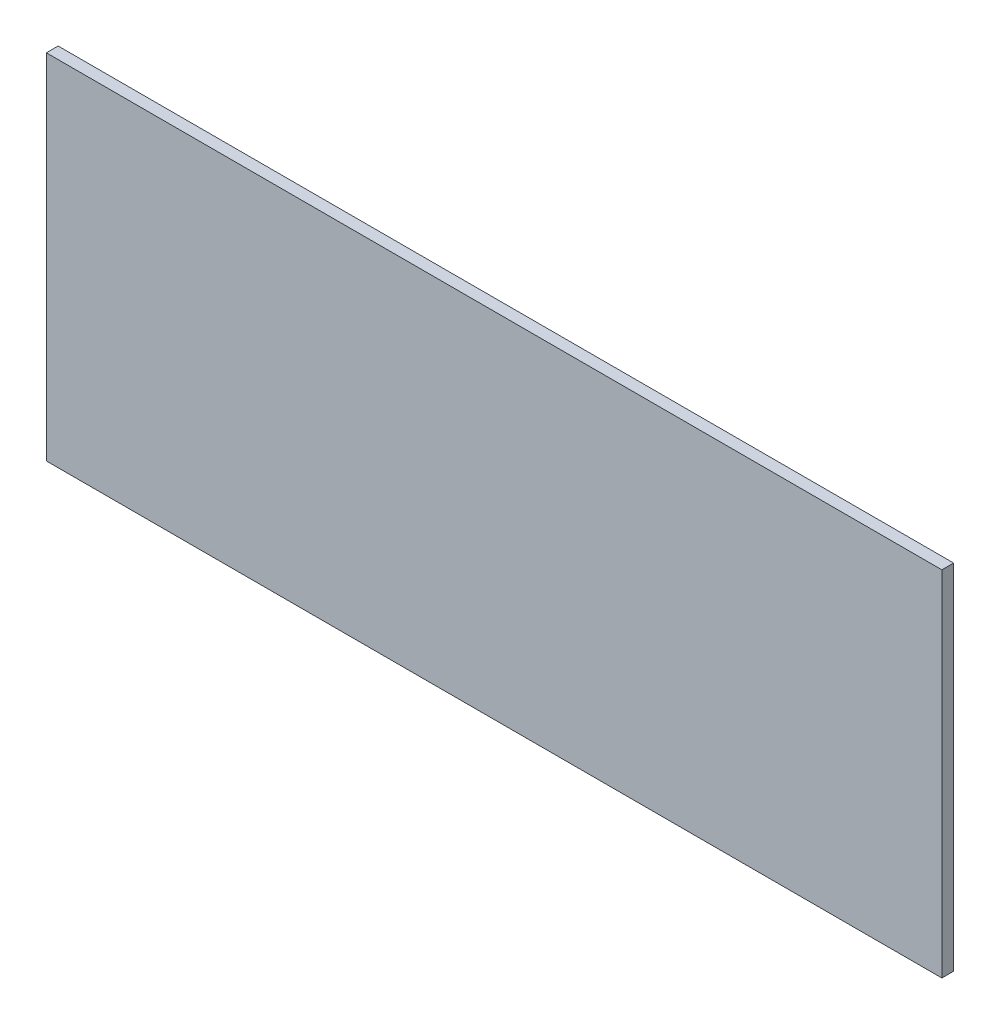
ISO-10303-21;
HEADER;
FILE_DESCRIPTION(('STEP AP214'),'2;1');
FILE_NAME('part.step','',(''),(''),'','','');
FILE_SCHEMA(('AUTOMOTIVE_DESIGN { 1 0 10303 214 1 1 1 1 }'));
ENDSEC;
DATA;
#1=APPLICATION_CONTEXT('core data for automotive mechanical design processes');
#2=APPLICATION_PROTOCOL_DEFINITION('international standard','automotive_design',2000,#1);
#3=PRODUCT_CONTEXT('',#1,'mechanical');
#4=PRODUCT('Part','Part','',(#3));
#5=PRODUCT_RELATED_PRODUCT_CATEGORY('part','',(#4));
#6=PRODUCT_DEFINITION_FORMATION('','',#4);
#7=PRODUCT_DEFINITION_CONTEXT('part definition',#1,'design');
#8=PRODUCT_DEFINITION('design','',#6,#7);
#9=PRODUCT_DEFINITION_SHAPE('','',#8);
#10=(LENGTH_UNIT() NAMED_UNIT(*) SI_UNIT(.MILLI.,.METRE.));
#11=(NAMED_UNIT(*) PLANE_ANGLE_UNIT() SI_UNIT($,.RADIAN.));
#12=(NAMED_UNIT(*) SI_UNIT($,.STERADIAN.) SOLID_ANGLE_UNIT());
#13=UNCERTAINTY_MEASURE_WITH_UNIT(LENGTH_MEASURE(1.E-05),#10,'distance_accuracy_value','');
#14=(GEOMETRIC_REPRESENTATION_CONTEXT(3) GLOBAL_UNCERTAINTY_ASSIGNED_CONTEXT((#13)) GLOBAL_UNIT_ASSIGNED_CONTEXT((#10,
#11,#12)) REPRESENTATION_CONTEXT('',''));
#15=CARTESIAN_POINT('',(0.,0.,0.));
#16=DIRECTION('',(0.,0.,1.));
#17=DIRECTION('',(1.,0.,0.));
#18=AXIS2_PLACEMENT_3D('',#15,#16,#17);
#19=CARTESIAN_POINT('',(-15.,-7.5,0.6));
#20=DIRECTION('',(1.,0.,0.));
#21=DIRECTION('',(0.,0.,-1.));
#22=AXIS2_PLACEMENT_3D('',#19,#20,#21);
#23=PLANE('',#22);
#24=DIRECTION('',(0.,-1.,0.));
#25=VECTOR('',#24,1.);
#26=CARTESIAN_POINT('',(-15.,-7.5,0.1));
#27=LINE('',#26,#25);
#28=CARTESIAN_POINT('',(-15.,7.5,0.1));
#29=VERTEX_POINT('',#28);
#30=CARTESIAN_POINT('',(-15.,-7.5,0.1));
#31=VERTEX_POINT('',#30);
#32=EDGE_CURVE('E95',#29,#31,#27,.T.);
#33=ORIENTED_EDGE('',*,*,#32,.T.);
#34=DIRECTION('',(0.,0.,-1.));
#35=VECTOR('',#34,1.);
#36=CARTESIAN_POINT('',(-15.,-7.5,0.6));
#37=LINE('',#36,#35);
#38=CARTESIAN_POINT('',(-15.,-7.5,0.6));
#39=VERTEX_POINT('',#38);
#40=EDGE_CURVE('E11',#39,#31,#37,.T.);
#41=ORIENTED_EDGE('',*,*,#40,.F.);
#42=DIRECTION('',(0.,-1.,0.));
#43=VECTOR('',#42,1.);
#44=CARTESIAN_POINT('',(-15.,-7.5,0.6));
#45=LINE('',#44,#43);
#46=CARTESIAN_POINT('',(-15.,7.5,0.6));
#47=VERTEX_POINT('',#46);
#48=EDGE_CURVE('E83',#47,#39,#45,.T.);
#49=ORIENTED_EDGE('',*,*,#48,.F.);
#50=DIRECTION('',(0.,0.,-1.));
#51=VECTOR('',#50,1.);
#52=CARTESIAN_POINT('',(-15.,7.5,0.6));
#53=LINE('',#52,#51);
#54=EDGE_CURVE('E91',#47,#29,#53,.T.);
#55=ORIENTED_EDGE('',*,*,#54,.T.);
#56=EDGE_LOOP('',(#33,#41,#49,#55));
#57=FACE_BOUND('',#56,.T.);
#58=ADVANCED_FACE('F32',(#57),#23,.F.);
#59=CARTESIAN_POINT('',(-15.,-7.5,0.6));
#60=DIRECTION('',(0.,1.,0.));
#61=DIRECTION('',(0.,0.,1.));
#62=AXIS2_PLACEMENT_3D('',#59,#60,#61);
#63=PLANE('',#62);
#64=DIRECTION('',(1.,0.,0.));
#65=VECTOR('',#64,1.);
#66=CARTESIAN_POINT('',(-15.,-7.5,0.1));
#67=LINE('',#66,#65);
#68=CARTESIAN_POINT('',(23.,-7.5,0.1));
#69=VERTEX_POINT('',#68);
#70=EDGE_CURVE('E87',#31,#69,#67,.T.);
#71=ORIENTED_EDGE('',*,*,#70,.T.);
#72=DIRECTION('',(0.,0.,-1.));
#73=VECTOR('',#72,1.);
#74=CARTESIAN_POINT('',(23.,-7.5,0.6));
#75=LINE('',#74,#73);
#76=CARTESIAN_POINT('',(23.,-7.5,0.6));
#77=VERTEX_POINT('',#76);
#78=EDGE_CURVE('E40',#77,#69,#75,.T.);
#79=ORIENTED_EDGE('',*,*,#78,.F.);
#80=DIRECTION('',(1.,0.,0.));
#81=VECTOR('',#80,1.);
#82=CARTESIAN_POINT('',(-15.,-7.5,0.6));
#83=LINE('',#82,#81);
#84=EDGE_CURVE('E78',#39,#77,#83,.T.);
#85=ORIENTED_EDGE('',*,*,#84,.F.);
#86=ORIENTED_EDGE('',*,*,#40,.T.);
#87=EDGE_LOOP('',(#71,#79,#85,#86));
#88=FACE_BOUND('',#87,.T.);
#89=ADVANCED_FACE('F86',(#88),#63,.F.);
#90=CARTESIAN_POINT('',(23.,-7.5,0.6));
#91=DIRECTION('',(-1.,0.,0.));
#92=DIRECTION('',(0.,0.,1.));
#93=AXIS2_PLACEMENT_3D('',#90,#91,#92);
#94=PLANE('',#93);
#95=DIRECTION('',(0.,1.,0.));
#96=VECTOR('',#95,1.);
#97=CARTESIAN_POINT('',(23.,-7.5,0.1));
#98=LINE('',#97,#96);
#99=CARTESIAN_POINT('',(23.,7.5,0.1));
#100=VERTEX_POINT('',#99);
#101=EDGE_CURVE('E65',#69,#100,#98,.T.);
#102=ORIENTED_EDGE('',*,*,#101,.T.);
#103=DIRECTION('',(0.,0.,-1.));
#104=VECTOR('',#103,1.);
#105=CARTESIAN_POINT('',(23.,7.5,0.6));
#106=LINE('',#105,#104);
#107=CARTESIAN_POINT('',(23.,7.5,0.6));
#108=VERTEX_POINT('',#107);
#109=EDGE_CURVE('E88',#108,#100,#106,.T.);
#110=ORIENTED_EDGE('',*,*,#109,.F.);
#111=DIRECTION('',(0.,1.,0.));
#112=VECTOR('',#111,1.);
#113=CARTESIAN_POINT('',(23.,-7.5,0.6));
#114=LINE('',#113,#112);
#115=EDGE_CURVE('E81',#77,#108,#114,.T.);
#116=ORIENTED_EDGE('',*,*,#115,.F.);
#117=ORIENTED_EDGE('',*,*,#78,.T.);
#118=EDGE_LOOP('',(#102,#110,#116,#117));
#119=FACE_BOUND('',#118,.T.);
#120=ADVANCED_FACE('F89',(#119),#94,.F.);
#121=CARTESIAN_POINT('',(-15.,7.5,0.6));
#122=DIRECTION('',(0.,-1.,0.));
#123=DIRECTION('',(0.,0.,-1.));
#124=AXIS2_PLACEMENT_3D('',#121,#122,#123);
#125=PLANE('',#124);
#126=DIRECTION('',(-1.,0.,0.));
#127=VECTOR('',#126,1.);
#128=CARTESIAN_POINT('',(-15.,7.5,0.1));
#129=LINE('',#128,#127);
#130=EDGE_CURVE('E71',#100,#29,#129,.T.);
#131=ORIENTED_EDGE('',*,*,#130,.T.);
#132=ORIENTED_EDGE('',*,*,#54,.F.);
#133=DIRECTION('',(-1.,0.,0.));
#134=VECTOR('',#133,1.);
#135=CARTESIAN_POINT('',(-15.,7.5,0.6));
#136=LINE('',#135,#134);
#137=EDGE_CURVE('E48',#108,#47,#136,.T.);
#138=ORIENTED_EDGE('',*,*,#137,.F.);
#139=ORIENTED_EDGE('',*,*,#109,.T.);
#140=EDGE_LOOP('',(#131,#132,#138,#139));
#141=FACE_BOUND('',#140,.T.);
#142=ADVANCED_FACE('F102',(#141),#125,.F.);
#143=CARTESIAN_POINT('',(0.,0.,0.6));
#144=DIRECTION('',(0.,0.,-1.));
#145=DIRECTION('',(-1.,0.,0.));
#146=AXIS2_PLACEMENT_3D('',#143,#144,#145);
#147=PLANE('',#146);
#148=ORIENTED_EDGE('',*,*,#48,.T.);
#149=ORIENTED_EDGE('',*,*,#84,.T.);
#150=ORIENTED_EDGE('',*,*,#115,.T.);
#151=ORIENTED_EDGE('',*,*,#137,.T.);
#152=EDGE_LOOP('',(#148,#149,#150,#151));
#153=FACE_BOUND('',#152,.T.);
#154=ADVANCED_FACE('F79',(#153),#147,.F.);
#155=CARTESIAN_POINT('',(0.,0.,0.1));
#156=DIRECTION('',(0.,0.,-1.));
#157=DIRECTION('',(-1.,0.,0.));
#158=AXIS2_PLACEMENT_3D('',#155,#156,#157);
#159=PLANE('',#158);
#160=ORIENTED_EDGE('',*,*,#32,.F.);
#161=ORIENTED_EDGE('',*,*,#130,.F.);
#162=ORIENTED_EDGE('',*,*,#101,.F.);
#163=ORIENTED_EDGE('',*,*,#70,.F.);
#164=EDGE_LOOP('',(#160,#161,#162,#163));
#165=FACE_BOUND('',#164,.T.);
#166=ADVANCED_FACE('F105',(#165),#159,.T.);
#167=CLOSED_SHELL('',(#58,#89,#120,#142,#154,#166));
#168=MANIFOLD_SOLID_BREP('B2',#167);
#169=ADVANCED_BREP_SHAPE_REPRESENTATION('',(#18,#168),#14);
#170=SHAPE_DEFINITION_REPRESENTATION(#9,#169);
ENDSEC;
END-ISO-10303-21;
